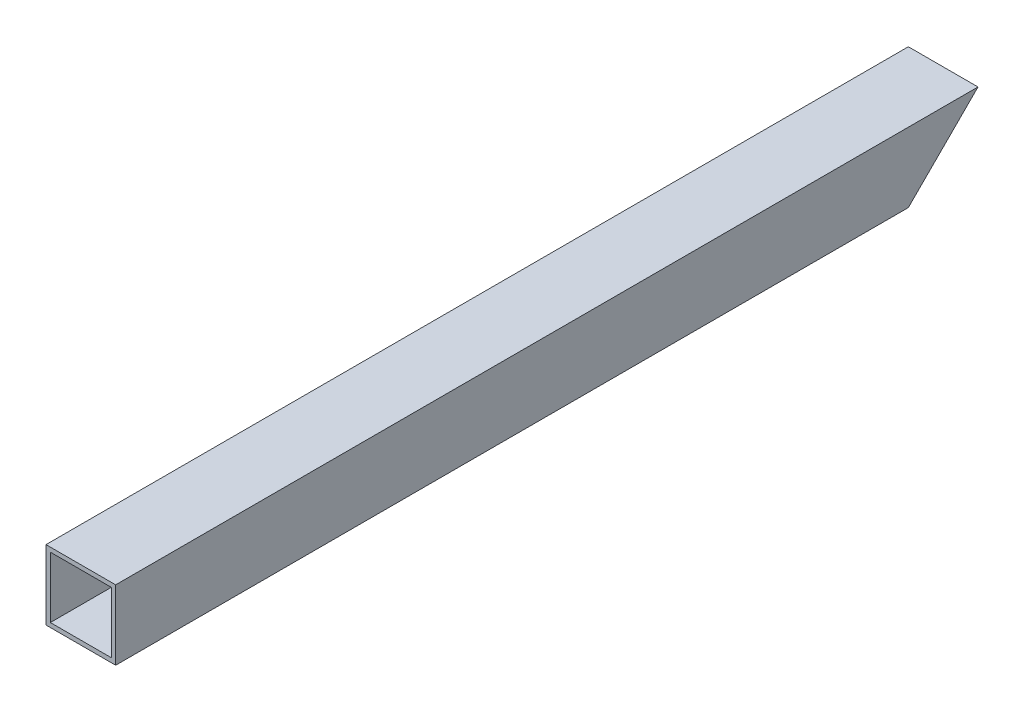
from build123d import *

# Parameters (mm, degrees)
SKETCH1_W               = 50.8
SKETCH1_H               = 50.8
SKETCH1_W_2             = 44.45
SKETCH1_H_2             = 44.45
BOSS_EXTRUDE1_DEPTH     = 628.8024
CUT_EXTRUDE1_DEPTH      = 632.362224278
CUT_EXTRUDE1_DEPTH_BACK = 632.362224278


with BuildPart() as part:
    # Sketch1 → Boss-Extrude1 (new body)
    with BuildSketch(Plane.XY):
        Rectangle(SKETCH1_W, SKETCH1_H)
        Rectangle(SKETCH1_W_2, SKETCH1_H_2, mode=Mode.SUBTRACT)
    extrude(amount=-BOSS_EXTRUDE1_DEPTH)

    # Sketch2 → Cut-Extrude1 (cut, two sides: drawn at the far end of the back side and taken through both)
    with BuildSketch(Plane.ZY.offset(25.4).offset(-CUT_EXTRUDE1_DEPTH_BACK)):
        Polygon((-1528.031635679, 924.629235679), (-628.8024, 25.4), (-578.0024, -25.4), (321.226835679, -924.629235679), (-1477.231635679, -2723.087707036), (-3326.490107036, -873.829235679), align=None)
    extrude(amount=CUT_EXTRUDE1_DEPTH + CUT_EXTRUDE1_DEPTH_BACK, mode=Mode.SUBTRACT)


solid = part.part
